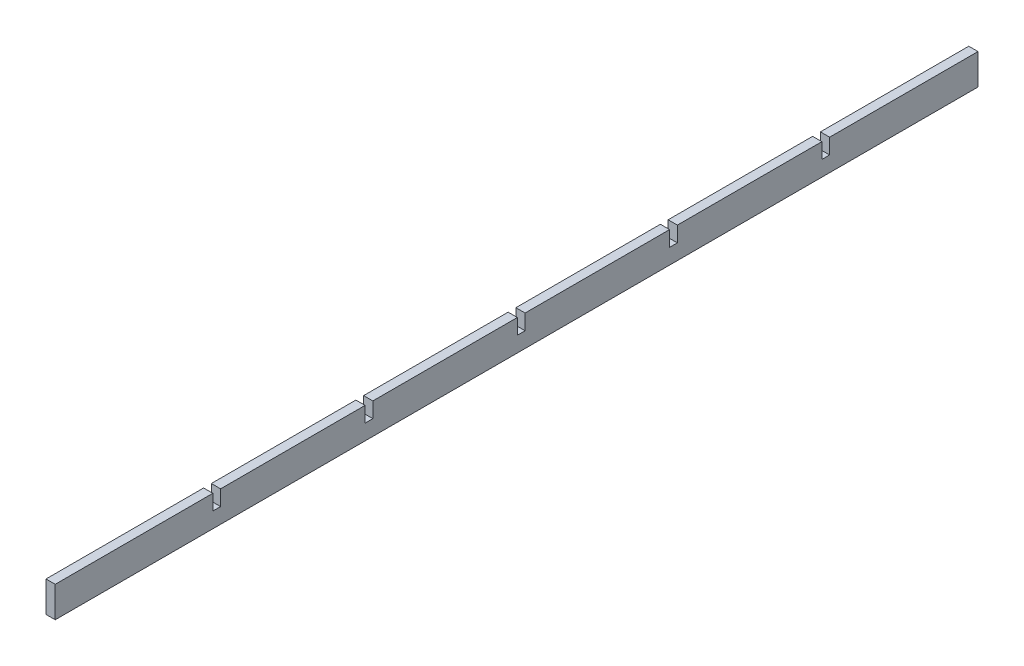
ISO-10303-21;
HEADER;
FILE_DESCRIPTION(('STEP AP214'),'2;1');
FILE_NAME('part.step','',(''),(''),'','','');
FILE_SCHEMA(('AUTOMOTIVE_DESIGN { 1 0 10303 214 1 1 1 1 }'));
ENDSEC;
DATA;
#1=APPLICATION_CONTEXT('core data for automotive mechanical design processes');
#2=APPLICATION_PROTOCOL_DEFINITION('international standard','automotive_design',2000,#1);
#3=PRODUCT_CONTEXT('',#1,'mechanical');
#4=PRODUCT('Part','Part','',(#3));
#5=PRODUCT_RELATED_PRODUCT_CATEGORY('part','',(#4));
#6=PRODUCT_DEFINITION_FORMATION('','',#4);
#7=PRODUCT_DEFINITION_CONTEXT('part definition',#1,'design');
#8=PRODUCT_DEFINITION('design','',#6,#7);
#9=PRODUCT_DEFINITION_SHAPE('','',#8);
#10=(LENGTH_UNIT() NAMED_UNIT(*) SI_UNIT(.MILLI.,.METRE.));
#11=(NAMED_UNIT(*) PLANE_ANGLE_UNIT() SI_UNIT($,.RADIAN.));
#12=(NAMED_UNIT(*) SI_UNIT($,.STERADIAN.) SOLID_ANGLE_UNIT());
#13=UNCERTAINTY_MEASURE_WITH_UNIT(LENGTH_MEASURE(1.E-05),#10,'distance_accuracy_value','');
#14=(GEOMETRIC_REPRESENTATION_CONTEXT(3) GLOBAL_UNCERTAINTY_ASSIGNED_CONTEXT((#13)) GLOBAL_UNIT_ASSIGNED_CONTEXT((#10,
#11,#12)) REPRESENTATION_CONTEXT('',''));
#15=CARTESIAN_POINT('',(0.,0.,0.));
#16=DIRECTION('',(0.,0.,1.));
#17=DIRECTION('',(1.,0.,0.));
#18=AXIS2_PLACEMENT_3D('',#15,#16,#17);
#19=CARTESIAN_POINT('',(3.,5.,148.5));
#20=DIRECTION('',(0.,-1.,0.));
#21=DIRECTION('',(0.,0.,-1.));
#22=AXIS2_PLACEMENT_3D('',#19,#20,#21);
#23=PLANE('',#22);
#24=DIRECTION('',(0.,0.,1.));
#25=VECTOR('',#24,1.);
#26=CARTESIAN_POINT('',(3.,5.,148.5));
#27=LINE('',#26,#25);
#28=CARTESIAN_POINT('',(3.,5.,-100.74));
#29=VERTEX_POINT('',#28);
#30=CARTESIAN_POINT('',(3.,4.99999999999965,-53.76));
#31=VERTEX_POINT('',#30);
#32=EDGE_CURVE('E308',#29,#31,#27,.T.);
#33=ORIENTED_EDGE('',*,*,#32,.F.);
#34=DIRECTION('',(1.,0.,0.));
#35=VECTOR('',#34,1.);
#36=CARTESIAN_POINT('',(-7.,5.,-100.74));
#37=LINE('',#36,#35);
#38=CARTESIAN_POINT('',(0.,5.,-100.74));
#39=VERTEX_POINT('',#38);
#40=EDGE_CURVE('E214',#39,#29,#37,.T.);
#41=ORIENTED_EDGE('',*,*,#40,.F.);
#42=DIRECTION('',(0.,0.,1.));
#43=VECTOR('',#42,1.);
#44=CARTESIAN_POINT('',(0.,5.,148.5));
#45=LINE('',#44,#43);
#46=CARTESIAN_POINT('',(0.,4.99999999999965,-53.76));
#47=VERTEX_POINT('',#46);
#48=EDGE_CURVE('E318',#39,#47,#45,.T.);
#49=ORIENTED_EDGE('',*,*,#48,.T.);
#50=DIRECTION('',(1.,0.,0.));
#51=VECTOR('',#50,1.);
#52=CARTESIAN_POINT('',(-7.,4.99999999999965,-53.76));
#53=LINE('',#52,#51);
#54=EDGE_CURVE('E237',#47,#31,#53,.T.);
#55=ORIENTED_EDGE('',*,*,#54,.T.);
#56=EDGE_LOOP('',(#33,#41,#49,#55));
#57=FACE_BOUND('',#56,.T.);
#58=ADVANCED_FACE('F40',(#57),#23,.F.);
#59=CARTESIAN_POINT('',(0.,5.,-151.5));
#60=VERTEX_POINT('',#59);
#61=CARTESIAN_POINT('',(0.,5.,-103.26));
#62=VERTEX_POINT('',#61);
#63=EDGE_CURVE('E300',#60,#62,#45,.T.);
#64=ORIENTED_EDGE('',*,*,#63,.T.);
#65=DIRECTION('',(1.,0.,0.));
#66=VECTOR('',#65,1.);
#67=CARTESIAN_POINT('',(-7.,5.,-103.26));
#68=LINE('',#67,#66);
#69=CARTESIAN_POINT('',(3.,5.,-103.26));
#70=VERTEX_POINT('',#69);
#71=EDGE_CURVE('E227',#62,#70,#68,.T.);
#72=ORIENTED_EDGE('',*,*,#71,.T.);
#73=CARTESIAN_POINT('',(3.,5.,-151.5));
#74=VERTEX_POINT('',#73);
#75=EDGE_CURVE('E305',#74,#70,#27,.T.);
#76=ORIENTED_EDGE('',*,*,#75,.F.);
#77=DIRECTION('',(-1.,0.,0.));
#78=VECTOR('',#77,1.);
#79=CARTESIAN_POINT('',(3.,5.,-151.5));
#80=LINE('',#79,#78);
#81=EDGE_CURVE('E321',#74,#60,#80,.T.);
#82=ORIENTED_EDGE('',*,*,#81,.T.);
#83=EDGE_LOOP('',(#64,#72,#76,#82));
#84=FACE_BOUND('',#83,.T.);
#85=ADVANCED_FACE('F374',(#84),#23,.F.);
#86=CARTESIAN_POINT('',(3.,4.99999999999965,-51.24));
#87=VERTEX_POINT('',#86);
#88=CARTESIAN_POINT('',(3.,4.99999999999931,-4.26000000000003));
#89=VERTEX_POINT('',#88);
#90=EDGE_CURVE('E418',#87,#89,#27,.T.);
#91=ORIENTED_EDGE('',*,*,#90,.F.);
#92=DIRECTION('',(1.,0.,0.));
#93=VECTOR('',#92,1.);
#94=CARTESIAN_POINT('',(-7.,4.99999999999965,-51.24));
#95=LINE('',#94,#93);
#96=CARTESIAN_POINT('',(0.,4.99999999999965,-51.24));
#97=VERTEX_POINT('',#96);
#98=EDGE_CURVE('E231',#97,#87,#95,.T.);
#99=ORIENTED_EDGE('',*,*,#98,.F.);
#100=CARTESIAN_POINT('',(0.,4.99999999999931,-4.26000000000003));
#101=VERTEX_POINT('',#100);
#102=EDGE_CURVE('E400',#97,#101,#45,.T.);
#103=ORIENTED_EDGE('',*,*,#102,.T.);
#104=DIRECTION('',(1.,0.,0.));
#105=VECTOR('',#104,1.);
#106=CARTESIAN_POINT('',(-7.,4.99999999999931,-4.26000000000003));
#107=LINE('',#106,#105);
#108=EDGE_CURVE('E253',#101,#89,#107,.T.);
#109=ORIENTED_EDGE('',*,*,#108,.T.);
#110=EDGE_LOOP('',(#91,#99,#103,#109));
#111=FACE_BOUND('',#110,.T.);
#112=ADVANCED_FACE('F457',(#111),#23,.F.);
#113=CARTESIAN_POINT('',(3.,4.99999999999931,-1.74000000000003));
#114=VERTEX_POINT('',#113);
#115=CARTESIAN_POINT('',(3.,4.99999999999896,45.2399999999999));
#116=VERTEX_POINT('',#115);
#117=EDGE_CURVE('E420',#114,#116,#27,.T.);
#118=ORIENTED_EDGE('',*,*,#117,.F.);
#119=DIRECTION('',(1.,0.,0.));
#120=VECTOR('',#119,1.);
#121=CARTESIAN_POINT('',(-7.,4.99999999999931,-1.74000000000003));
#122=LINE('',#121,#120);
#123=CARTESIAN_POINT('',(0.,4.99999999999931,-1.74000000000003));
#124=VERTEX_POINT('',#123);
#125=EDGE_CURVE('E246',#124,#114,#122,.T.);
#126=ORIENTED_EDGE('',*,*,#125,.F.);
#127=CARTESIAN_POINT('',(0.,4.99999999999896,45.2399999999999));
#128=VERTEX_POINT('',#127);
#129=EDGE_CURVE('E395',#124,#128,#45,.T.);
#130=ORIENTED_EDGE('',*,*,#129,.T.);
#131=DIRECTION('',(1.,0.,0.));
#132=VECTOR('',#131,1.);
#133=CARTESIAN_POINT('',(-7.,4.99999999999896,45.2399999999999));
#134=LINE('',#133,#132);
#135=EDGE_CURVE('E270',#128,#116,#134,.T.);
#136=ORIENTED_EDGE('',*,*,#135,.T.);
#137=EDGE_LOOP('',(#118,#126,#130,#136));
#138=FACE_BOUND('',#137,.T.);
#139=ADVANCED_FACE('F455',(#138),#23,.F.);
#140=CARTESIAN_POINT('',(3.,4.99999999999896,47.7599999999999));
#141=VERTEX_POINT('',#140);
#142=CARTESIAN_POINT('',(3.,4.99999999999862,94.7399999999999));
#143=VERTEX_POINT('',#142);
#144=EDGE_CURVE('E424',#141,#143,#27,.T.);
#145=ORIENTED_EDGE('',*,*,#144,.F.);
#146=DIRECTION('',(1.,0.,0.));
#147=VECTOR('',#146,1.);
#148=CARTESIAN_POINT('',(-7.,4.99999999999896,47.7599999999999));
#149=LINE('',#148,#147);
#150=CARTESIAN_POINT('',(0.,4.99999999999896,47.7599999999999));
#151=VERTEX_POINT('',#150);
#152=EDGE_CURVE('E263',#151,#141,#149,.T.);
#153=ORIENTED_EDGE('',*,*,#152,.F.);
#154=CARTESIAN_POINT('',(0.,4.99999999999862,94.7399999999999));
#155=VERTEX_POINT('',#154);
#156=EDGE_CURVE('E393',#151,#155,#45,.T.);
#157=ORIENTED_EDGE('',*,*,#156,.T.);
#158=DIRECTION('',(1.,0.,0.));
#159=VECTOR('',#158,1.);
#160=CARTESIAN_POINT('',(-7.,4.99999999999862,94.7399999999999));
#161=LINE('',#160,#159);
#162=EDGE_CURVE('E287',#155,#143,#161,.T.);
#163=ORIENTED_EDGE('',*,*,#162,.T.);
#164=EDGE_LOOP('',(#145,#153,#157,#163));
#165=FACE_BOUND('',#164,.T.);
#166=ADVANCED_FACE('F442',(#165),#23,.F.);
#167=CARTESIAN_POINT('',(3.,5.,148.5));
#168=DIRECTION('',(0.,0.,-1.));
#169=DIRECTION('',(-1.,0.,0.));
#170=AXIS2_PLACEMENT_3D('',#167,#168,#169);
#171=PLANE('',#170);
#172=DIRECTION('',(0.,-1.,0.));
#173=VECTOR('',#172,1.);
#174=CARTESIAN_POINT('',(0.,5.,148.5));
#175=LINE('',#174,#173);
#176=CARTESIAN_POINT('',(0.,5.,148.5));
#177=VERTEX_POINT('',#176);
#178=CARTESIAN_POINT('',(0.,-5.,148.5));
#179=VERTEX_POINT('',#178);
#180=EDGE_CURVE('E226',#177,#179,#175,.T.);
#181=ORIENTED_EDGE('',*,*,#180,.T.);
#182=DIRECTION('',(-1.,0.,0.));
#183=VECTOR('',#182,1.);
#184=CARTESIAN_POINT('',(3.,-5.,148.5));
#185=LINE('',#184,#183);
#186=CARTESIAN_POINT('',(3.,-5.,148.5));
#187=VERTEX_POINT('',#186);
#188=EDGE_CURVE('E327',#187,#179,#185,.T.);
#189=ORIENTED_EDGE('',*,*,#188,.F.);
#190=DIRECTION('',(0.,-1.,0.));
#191=VECTOR('',#190,1.);
#192=CARTESIAN_POINT('',(3.,5.,148.5));
#193=LINE('',#192,#191);
#194=CARTESIAN_POINT('',(3.,5.,148.5));
#195=VERTEX_POINT('',#194);
#196=EDGE_CURVE('E296',#195,#187,#193,.T.);
#197=ORIENTED_EDGE('',*,*,#196,.F.);
#198=DIRECTION('',(-1.,0.,0.));
#199=VECTOR('',#198,1.);
#200=CARTESIAN_POINT('',(3.,5.,148.5));
#201=LINE('',#200,#199);
#202=EDGE_CURVE('E307',#195,#177,#201,.T.);
#203=ORIENTED_EDGE('',*,*,#202,.T.);
#204=EDGE_LOOP('',(#181,#189,#197,#203));
#205=FACE_BOUND('',#204,.T.);
#206=ADVANCED_FACE('F42',(#205),#171,.F.);
#207=CARTESIAN_POINT('',(3.,-5.,148.5));
#208=DIRECTION('',(0.,1.,0.));
#209=DIRECTION('',(0.,0.,1.));
#210=AXIS2_PLACEMENT_3D('',#207,#208,#209);
#211=PLANE('',#210);
#212=DIRECTION('',(0.,0.,-1.));
#213=VECTOR('',#212,1.);
#214=CARTESIAN_POINT('',(0.,-5.,148.5));
#215=LINE('',#214,#213);
#216=CARTESIAN_POINT('',(0.,-5.,-151.5));
#217=VERTEX_POINT('',#216);
#218=EDGE_CURVE('E311',#179,#217,#215,.T.);
#219=ORIENTED_EDGE('',*,*,#218,.T.);
#220=DIRECTION('',(-1.,0.,0.));
#221=VECTOR('',#220,1.);
#222=CARTESIAN_POINT('',(3.,-5.,-151.5));
#223=LINE('',#222,#221);
#224=CARTESIAN_POINT('',(3.,-5.,-151.5));
#225=VERTEX_POINT('',#224);
#226=EDGE_CURVE('E324',#225,#217,#223,.T.);
#227=ORIENTED_EDGE('',*,*,#226,.F.);
#228=DIRECTION('',(0.,0.,-1.));
#229=VECTOR('',#228,1.);
#230=CARTESIAN_POINT('',(3.,-5.,148.5));
#231=LINE('',#230,#229);
#232=EDGE_CURVE('E299',#187,#225,#231,.T.);
#233=ORIENTED_EDGE('',*,*,#232,.F.);
#234=ORIENTED_EDGE('',*,*,#188,.T.);
#235=EDGE_LOOP('',(#219,#227,#233,#234));
#236=FACE_BOUND('',#235,.T.);
#237=ADVANCED_FACE('F385',(#236),#211,.F.);
#238=CARTESIAN_POINT('',(3.,5.,-151.5));
#239=DIRECTION('',(0.,0.,1.));
#240=DIRECTION('',(1.,0.,0.));
#241=AXIS2_PLACEMENT_3D('',#238,#239,#240);
#242=PLANE('',#241);
#243=DIRECTION('',(0.,1.,0.));
#244=VECTOR('',#243,1.);
#245=CARTESIAN_POINT('',(0.,5.,-151.5));
#246=LINE('',#245,#244);
#247=EDGE_CURVE('E313',#217,#60,#246,.T.);
#248=ORIENTED_EDGE('',*,*,#247,.T.);
#249=ORIENTED_EDGE('',*,*,#81,.F.);
#250=DIRECTION('',(0.,1.,0.));
#251=VECTOR('',#250,1.);
#252=CARTESIAN_POINT('',(3.,5.,-151.5));
#253=LINE('',#252,#251);
#254=EDGE_CURVE('E302',#225,#74,#253,.T.);
#255=ORIENTED_EDGE('',*,*,#254,.F.);
#256=ORIENTED_EDGE('',*,*,#226,.T.);
#257=EDGE_LOOP('',(#248,#249,#255,#256));
#258=FACE_BOUND('',#257,.T.);
#259=ADVANCED_FACE('F379',(#258),#242,.F.);
#260=CARTESIAN_POINT('',(3.,4.99999999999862,97.2599999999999));
#261=VERTEX_POINT('',#260);
#262=EDGE_CURVE('E304',#261,#195,#27,.T.);
#263=ORIENTED_EDGE('',*,*,#262,.F.);
#264=DIRECTION('',(1.,0.,0.));
#265=VECTOR('',#264,1.);
#266=CARTESIAN_POINT('',(-7.,4.99999999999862,97.2599999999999));
#267=LINE('',#266,#265);
#268=CARTESIAN_POINT('',(0.,4.99999999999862,97.2599999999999));
#269=VERTEX_POINT('',#268);
#270=EDGE_CURVE('E280',#269,#261,#267,.T.);
#271=ORIENTED_EDGE('',*,*,#270,.F.);
#272=EDGE_CURVE('E315',#269,#177,#45,.T.);
#273=ORIENTED_EDGE('',*,*,#272,.T.);
#274=ORIENTED_EDGE('',*,*,#202,.F.);
#275=EDGE_LOOP('',(#263,#271,#273,#274));
#276=FACE_BOUND('',#275,.T.);
#277=ADVANCED_FACE('F391',(#276),#23,.F.);
#278=CARTESIAN_POINT('',(3.,0.,0.));
#279=DIRECTION('',(1.,0.,0.));
#280=DIRECTION('',(0.,0.,-1.));
#281=AXIS2_PLACEMENT_3D('',#278,#279,#280);
#282=PLANE('',#281);
#283=DIRECTION('',(0.,-1.,0.));
#284=VECTOR('',#283,1.);
#285=CARTESIAN_POINT('',(3.,5.,-100.74));
#286=LINE('',#285,#284);
#287=CARTESIAN_POINT('',(3.,0.,-100.74));
#288=VERTEX_POINT('',#287);
#289=EDGE_CURVE('E211',#29,#288,#286,.T.);
#290=ORIENTED_EDGE('',*,*,#289,.F.);
#291=ORIENTED_EDGE('',*,*,#32,.T.);
#292=DIRECTION('',(0.,1.,0.));
#293=VECTOR('',#292,1.);
#294=CARTESIAN_POINT('',(3.,4.99999999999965,-53.76));
#295=LINE('',#294,#293);
#296=CARTESIAN_POINT('',(3.,-3.46369708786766E-13,-53.76));
#297=VERTEX_POINT('',#296);
#298=EDGE_CURVE('E233',#297,#31,#295,.T.);
#299=ORIENTED_EDGE('',*,*,#298,.F.);
#300=DIRECTION('',(0.,0.,-1.));
#301=VECTOR('',#300,1.);
#302=CARTESIAN_POINT('',(3.,-3.46524014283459E-13,-51.24));
#303=LINE('',#302,#301);
#304=CARTESIAN_POINT('',(3.,-3.46524014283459E-13,-51.24));
#305=VERTEX_POINT('',#304);
#306=EDGE_CURVE('E242',#305,#297,#303,.T.);
#307=ORIENTED_EDGE('',*,*,#306,.F.);
#308=DIRECTION('',(0.,-1.,0.));
#309=VECTOR('',#308,1.);
#310=CARTESIAN_POINT('',(3.,4.99999999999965,-51.24));
#311=LINE('',#310,#309);
#312=EDGE_CURVE('E218',#87,#305,#311,.T.);
#313=ORIENTED_EDGE('',*,*,#312,.F.);
#314=ORIENTED_EDGE('',*,*,#90,.T.);
#315=DIRECTION('',(0.,1.,0.));
#316=VECTOR('',#315,1.);
#317=CARTESIAN_POINT('',(3.,4.99999999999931,-4.26000000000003));
#318=LINE('',#317,#316);
#319=CARTESIAN_POINT('',(3.,-6.92026361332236E-13,-4.26000000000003));
#320=VERTEX_POINT('',#319);
#321=EDGE_CURVE('E248',#320,#89,#318,.T.);
#322=ORIENTED_EDGE('',*,*,#321,.F.);
#323=DIRECTION('',(0.,0.,-1.));
#324=VECTOR('',#323,1.);
#325=CARTESIAN_POINT('',(3.,-6.92180666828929E-13,-1.74000000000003));
#326=LINE('',#325,#324);
#327=CARTESIAN_POINT('',(3.,-6.92180666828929E-13,-1.74000000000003));
#328=VERTEX_POINT('',#327);
#329=EDGE_CURVE('E258',#328,#320,#326,.T.);
#330=ORIENTED_EDGE('',*,*,#329,.F.);
#331=DIRECTION('',(0.,-1.,0.));
#332=VECTOR('',#331,1.);
#333=CARTESIAN_POINT('',(3.,4.99999999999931,-1.74000000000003));
#334=LINE('',#333,#332);
#335=EDGE_CURVE('E240',#114,#328,#334,.T.);
#336=ORIENTED_EDGE('',*,*,#335,.F.);
#337=ORIENTED_EDGE('',*,*,#117,.T.);
#338=DIRECTION('',(0.,1.,0.));
#339=VECTOR('',#338,1.);
#340=CARTESIAN_POINT('',(3.,4.99999999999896,45.2399999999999));
#341=LINE('',#340,#339);
#342=CARTESIAN_POINT('',(3.,-1.03768301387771E-12,45.2399999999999));
#343=VERTEX_POINT('',#342);
#344=EDGE_CURVE('E265',#343,#116,#341,.T.);
#345=ORIENTED_EDGE('',*,*,#344,.F.);
#346=DIRECTION('',(0.,0.,-1.));
#347=VECTOR('',#346,1.);
#348=CARTESIAN_POINT('',(3.,-1.0378373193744E-12,47.7599999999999));
#349=LINE('',#348,#347);
#350=CARTESIAN_POINT('',(3.,-1.0378373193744E-12,47.7599999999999));
#351=VERTEX_POINT('',#350);
#352=EDGE_CURVE('E275',#351,#343,#349,.T.);
#353=ORIENTED_EDGE('',*,*,#352,.F.);
#354=DIRECTION('',(0.,-1.,0.));
#355=VECTOR('',#354,1.);
#356=CARTESIAN_POINT('',(3.,4.99999999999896,47.7599999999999));
#357=LINE('',#356,#355);
#358=EDGE_CURVE('E256',#141,#351,#357,.T.);
#359=ORIENTED_EDGE('',*,*,#358,.F.);
#360=ORIENTED_EDGE('',*,*,#144,.T.);
#361=DIRECTION('',(0.,1.,0.));
#362=VECTOR('',#361,1.);
#363=CARTESIAN_POINT('',(3.,4.99999999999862,94.7399999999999));
#364=LINE('',#363,#362);
#365=CARTESIAN_POINT('',(3.,-1.38333966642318E-12,94.7399999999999));
#366=VERTEX_POINT('',#365);
#367=EDGE_CURVE('E282',#366,#143,#364,.T.);
#368=ORIENTED_EDGE('',*,*,#367,.F.);
#369=DIRECTION('',(0.,0.,-1.));
#370=VECTOR('',#369,1.);
#371=CARTESIAN_POINT('',(3.,-1.38349397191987E-12,97.2599999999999));
#372=LINE('',#371,#370);
#373=CARTESIAN_POINT('',(3.,-1.38349397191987E-12,97.2599999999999));
#374=VERTEX_POINT('',#373);
#375=EDGE_CURVE('E291',#374,#366,#372,.T.);
#376=ORIENTED_EDGE('',*,*,#375,.F.);
#377=DIRECTION('',(0.,-1.,0.));
#378=VECTOR('',#377,1.);
#379=CARTESIAN_POINT('',(3.,4.99999999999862,97.2599999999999));
#380=LINE('',#379,#378);
#381=EDGE_CURVE('E273',#261,#374,#380,.T.);
#382=ORIENTED_EDGE('',*,*,#381,.F.);
#383=ORIENTED_EDGE('',*,*,#262,.T.);
#384=ORIENTED_EDGE('',*,*,#196,.T.);
#385=ORIENTED_EDGE('',*,*,#232,.T.);
#386=ORIENTED_EDGE('',*,*,#254,.T.);
#387=ORIENTED_EDGE('',*,*,#75,.T.);
#388=DIRECTION('',(0.,1.,0.));
#389=VECTOR('',#388,1.);
#390=CARTESIAN_POINT('',(3.,5.,-103.26));
#391=LINE('',#390,#389);
#392=CARTESIAN_POINT('',(3.,0.,-103.26));
#393=VERTEX_POINT('',#392);
#394=EDGE_CURVE('E208',#393,#70,#391,.T.);
#395=ORIENTED_EDGE('',*,*,#394,.F.);
#396=DIRECTION('',(0.,0.,-1.));
#397=VECTOR('',#396,1.);
#398=CARTESIAN_POINT('',(3.,0.,-100.74));
#399=LINE('',#398,#397);
#400=EDGE_CURVE('E203',#288,#393,#399,.T.);
#401=ORIENTED_EDGE('',*,*,#400,.F.);
#402=EDGE_LOOP('',(#290,#291,#299,#307,#313,#314,#322,#330,#336,#337,#345,#353,#359,#360,#368,
#376,#382,#383,#384,#385,#386,#387,#395,#401));
#403=FACE_BOUND('',#402,.T.);
#404=ADVANCED_FACE('F220',(#403),#282,.T.);
#405=CARTESIAN_POINT('',(0.,0.,0.));
#406=DIRECTION('',(1.,0.,0.));
#407=DIRECTION('',(0.,0.,-1.));
#408=AXIS2_PLACEMENT_3D('',#405,#406,#407);
#409=PLANE('',#408);
#410=ORIENTED_EDGE('',*,*,#48,.F.);
#411=DIRECTION('',(0.,-1.,0.));
#412=VECTOR('',#411,1.);
#413=CARTESIAN_POINT('',(0.,0.,-100.74));
#414=LINE('',#413,#412);
#415=CARTESIAN_POINT('',(0.,0.,-100.74));
#416=VERTEX_POINT('',#415);
#417=EDGE_CURVE('E11',#39,#416,#414,.T.);
#418=ORIENTED_EDGE('',*,*,#417,.T.);
#419=DIRECTION('',(0.,0.,-1.));
#420=VECTOR('',#419,1.);
#421=CARTESIAN_POINT('',(0.,0.,0.));
#422=LINE('',#421,#420);
#423=CARTESIAN_POINT('',(0.,0.,-103.26));
#424=VERTEX_POINT('',#423);
#425=EDGE_CURVE('E206',#416,#424,#422,.T.);
#426=ORIENTED_EDGE('',*,*,#425,.T.);
#427=DIRECTION('',(0.,1.,0.));
#428=VECTOR('',#427,1.);
#429=CARTESIAN_POINT('',(0.,0.,-103.26));
#430=LINE('',#429,#428);
#431=EDGE_CURVE('E48',#424,#62,#430,.T.);
#432=ORIENTED_EDGE('',*,*,#431,.T.);
#433=ORIENTED_EDGE('',*,*,#63,.F.);
#434=ORIENTED_EDGE('',*,*,#247,.F.);
#435=ORIENTED_EDGE('',*,*,#218,.F.);
#436=ORIENTED_EDGE('',*,*,#180,.F.);
#437=ORIENTED_EDGE('',*,*,#272,.F.);
#438=DIRECTION('',(0.,-1.,0.));
#439=VECTOR('',#438,1.);
#440=CARTESIAN_POINT('',(0.,0.,97.2599999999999));
#441=LINE('',#440,#439);
#442=CARTESIAN_POINT('',(0.,-1.38349397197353E-12,97.2599999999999));
#443=VERTEX_POINT('',#442);
#444=EDGE_CURVE('E330',#269,#443,#441,.T.);
#445=ORIENTED_EDGE('',*,*,#444,.T.);
#446=DIRECTION('',(0.,0.,-1.));
#447=VECTOR('',#446,1.);
#448=CARTESIAN_POINT('',(0.,-1.37753851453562E-12,0.));
#449=LINE('',#448,#447);
#450=CARTESIAN_POINT('',(0.,-1.38333966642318E-12,94.7399999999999));
#451=VERTEX_POINT('',#450);
#452=EDGE_CURVE('E333',#443,#451,#449,.T.);
#453=ORIENTED_EDGE('',*,*,#452,.T.);
#454=DIRECTION('',(0.,1.,0.));
#455=VECTOR('',#454,1.);
#456=CARTESIAN_POINT('',(0.,0.,94.7399999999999));
#457=LINE('',#456,#455);
#458=EDGE_CURVE('E336',#451,#155,#457,.T.);
#459=ORIENTED_EDGE('',*,*,#458,.T.);
#460=ORIENTED_EDGE('',*,*,#156,.F.);
#461=DIRECTION('',(0.,-1.,0.));
#462=VECTOR('',#461,1.);
#463=CARTESIAN_POINT('',(0.,0.,47.7599999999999));
#464=LINE('',#463,#462);
#465=CARTESIAN_POINT('',(0.,-1.03783731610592E-12,47.7599999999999));
#466=VERTEX_POINT('',#465);
#467=EDGE_CURVE('E339',#151,#466,#464,.T.);
#468=ORIENTED_EDGE('',*,*,#467,.T.);
#469=DIRECTION('',(0.,0.,-1.));
#470=VECTOR('',#469,1.);
#471=CARTESIAN_POINT('',(0.,-1.03491286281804E-12,0.));
#472=LINE('',#471,#470);
#473=CARTESIAN_POINT('',(0.,-1.03768301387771E-12,45.2399999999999));
#474=VERTEX_POINT('',#473);
#475=EDGE_CURVE('E342',#466,#474,#472,.T.);
#476=ORIENTED_EDGE('',*,*,#475,.T.);
#477=DIRECTION('',(0.,1.,0.));
#478=VECTOR('',#477,1.);
#479=CARTESIAN_POINT('',(0.,0.,45.2399999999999));
#480=LINE('',#479,#478);
#481=EDGE_CURVE('E345',#474,#128,#480,.T.);
#482=ORIENTED_EDGE('',*,*,#481,.T.);
#483=ORIENTED_EDGE('',*,*,#129,.F.);
#484=DIRECTION('',(0.,-1.,0.));
#485=VECTOR('',#484,1.);
#486=CARTESIAN_POINT('',(0.,0.,-1.74000000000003));
#487=LINE('',#486,#485);
#488=CARTESIAN_POINT('',(0.,-6.9218066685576E-13,-1.74000000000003));
#489=VERTEX_POINT('',#488);
#490=EDGE_CURVE('E348',#124,#489,#487,.T.);
#491=ORIENTED_EDGE('',*,*,#490,.T.);
#492=DIRECTION('',(0.,0.,-1.));
#493=VECTOR('',#492,1.);
#494=CARTESIAN_POINT('',(0.,-6.92287211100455E-13,0.));
#495=LINE('',#494,#493);
#496=CARTESIAN_POINT('',(0.,-6.92026361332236E-13,-4.26000000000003));
#497=VERTEX_POINT('',#496);
#498=EDGE_CURVE('E351',#489,#497,#495,.T.);
#499=ORIENTED_EDGE('',*,*,#498,.T.);
#500=DIRECTION('',(0.,1.,0.));
#501=VECTOR('',#500,1.);
#502=CARTESIAN_POINT('',(0.,0.,-4.26000000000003));
#503=LINE('',#502,#501);
#504=EDGE_CURVE('E354',#497,#101,#503,.T.);
#505=ORIENTED_EDGE('',*,*,#504,.T.);
#506=ORIENTED_EDGE('',*,*,#102,.F.);
#507=DIRECTION('',(0.,-1.,0.));
#508=VECTOR('',#507,1.);
#509=CARTESIAN_POINT('',(0.,0.,-51.24));
#510=LINE('',#509,#508);
#511=CARTESIAN_POINT('',(0.,-3.46524010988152E-13,-51.24));
#512=VERTEX_POINT('',#511);
#513=EDGE_CURVE('E357',#97,#512,#510,.T.);
#514=ORIENTED_EDGE('',*,*,#513,.T.);
#515=DIRECTION('',(0.,0.,-1.));
#516=VECTOR('',#515,1.);
#517=CARTESIAN_POINT('',(0.,-3.49661559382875E-13,0.));
#518=LINE('',#517,#516);
#519=CARTESIAN_POINT('',(0.,-3.46369708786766E-13,-53.76));
#520=VERTEX_POINT('',#519);
#521=EDGE_CURVE('E360',#512,#520,#518,.T.);
#522=ORIENTED_EDGE('',*,*,#521,.T.);
#523=DIRECTION('',(0.,1.,0.));
#524=VECTOR('',#523,1.);
#525=CARTESIAN_POINT('',(0.,0.,-53.76));
#526=LINE('',#525,#524);
#527=EDGE_CURVE('E363',#520,#47,#526,.T.);
#528=ORIENTED_EDGE('',*,*,#527,.T.);
#529=EDGE_LOOP('',(#410,#418,#426,#432,#433,#434,#435,#436,#437,#445,#453,#459,#460,#468,#476,
#482,#483,#491,#499,#505,#506,#514,#522,#528));
#530=FACE_BOUND('',#529,.T.);
#531=ADVANCED_FACE('F370',(#530),#409,.F.);
#532=CARTESIAN_POINT('',(-7.,4.99999999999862,94.7399999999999));
#533=DIRECTION('',(0.,0.,-1.));
#534=DIRECTION('',(-1.,0.,0.));
#535=AXIS2_PLACEMENT_3D('',#532,#533,#534);
#536=PLANE('',#535);
#537=DIRECTION('',(1.,0.,0.));
#538=VECTOR('',#537,1.);
#539=CARTESIAN_POINT('',(-7.,-1.38333966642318E-12,94.7399999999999));
#540=LINE('',#539,#538);
#541=EDGE_CURVE('E285',#451,#366,#540,.T.);
#542=ORIENTED_EDGE('',*,*,#541,.T.);
#543=ORIENTED_EDGE('',*,*,#367,.T.);
#544=ORIENTED_EDGE('',*,*,#162,.F.);
#545=ORIENTED_EDGE('',*,*,#458,.F.);
#546=EDGE_LOOP('',(#542,#543,#544,#545));
#547=FACE_BOUND('',#546,.T.);
#548=ADVANCED_FACE('F441',(#547),#536,.F.);
#549=CARTESIAN_POINT('',(-7.,-1.38349397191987E-12,97.2599999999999));
#550=DIRECTION('',(0.,-1.,0.));
#551=DIRECTION('',(0.,0.,-1.));
#552=AXIS2_PLACEMENT_3D('',#549,#550,#551);
#553=PLANE('',#552);
#554=DIRECTION('',(1.,0.,0.));
#555=VECTOR('',#554,1.);
#556=CARTESIAN_POINT('',(-7.,-1.38349397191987E-12,97.2599999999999));
#557=LINE('',#556,#555);
#558=EDGE_CURVE('E283',#443,#374,#557,.T.);
#559=ORIENTED_EDGE('',*,*,#558,.T.);
#560=ORIENTED_EDGE('',*,*,#375,.T.);
#561=ORIENTED_EDGE('',*,*,#541,.F.);
#562=ORIENTED_EDGE('',*,*,#452,.F.);
#563=EDGE_LOOP('',(#559,#560,#561,#562));
#564=FACE_BOUND('',#563,.T.);
#565=ADVANCED_FACE('F439',(#564),#553,.F.);
#566=CARTESIAN_POINT('',(-7.,4.99999999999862,97.2599999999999));
#567=DIRECTION('',(0.,0.,1.));
#568=DIRECTION('',(1.,0.,0.));
#569=AXIS2_PLACEMENT_3D('',#566,#567,#568);
#570=PLANE('',#569);
#571=ORIENTED_EDGE('',*,*,#270,.T.);
#572=ORIENTED_EDGE('',*,*,#381,.T.);
#573=ORIENTED_EDGE('',*,*,#558,.F.);
#574=ORIENTED_EDGE('',*,*,#444,.F.);
#575=EDGE_LOOP('',(#571,#572,#573,#574));
#576=FACE_BOUND('',#575,.T.);
#577=ADVANCED_FACE('F435',(#576),#570,.F.);
#578=CARTESIAN_POINT('',(-7.,4.99999999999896,45.2399999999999));
#579=DIRECTION('',(0.,0.,-1.));
#580=DIRECTION('',(-1.,0.,0.));
#581=AXIS2_PLACEMENT_3D('',#578,#579,#580);
#582=PLANE('',#581);
#583=DIRECTION('',(1.,0.,0.));
#584=VECTOR('',#583,1.);
#585=CARTESIAN_POINT('',(-7.,-1.03768301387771E-12,45.2399999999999));
#586=LINE('',#585,#584);
#587=EDGE_CURVE('E268',#474,#343,#586,.T.);
#588=ORIENTED_EDGE('',*,*,#587,.T.);
#589=ORIENTED_EDGE('',*,*,#344,.T.);
#590=ORIENTED_EDGE('',*,*,#135,.F.);
#591=ORIENTED_EDGE('',*,*,#481,.F.);
#592=EDGE_LOOP('',(#588,#589,#590,#591));
#593=FACE_BOUND('',#592,.T.);
#594=ADVANCED_FACE('F451',(#593),#582,.F.);
#595=CARTESIAN_POINT('',(-7.,-1.0378373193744E-12,47.7599999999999));
#596=DIRECTION('',(0.,-1.,0.));
#597=DIRECTION('',(0.,0.,-1.));
#598=AXIS2_PLACEMENT_3D('',#595,#596,#597);
#599=PLANE('',#598);
#600=DIRECTION('',(1.,0.,0.));
#601=VECTOR('',#600,1.);
#602=CARTESIAN_POINT('',(-7.,-1.0378373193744E-12,47.7599999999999));
#603=LINE('',#602,#601);
#604=EDGE_CURVE('E266',#466,#351,#603,.T.);
#605=ORIENTED_EDGE('',*,*,#604,.T.);
#606=ORIENTED_EDGE('',*,*,#352,.T.);
#607=ORIENTED_EDGE('',*,*,#587,.F.);
#608=ORIENTED_EDGE('',*,*,#475,.F.);
#609=EDGE_LOOP('',(#605,#606,#607,#608));
#610=FACE_BOUND('',#609,.T.);
#611=ADVANCED_FACE('F449',(#610),#599,.F.);
#612=CARTESIAN_POINT('',(-7.,4.99999999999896,47.7599999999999));
#613=DIRECTION('',(0.,0.,1.));
#614=DIRECTION('',(1.,0.,0.));
#615=AXIS2_PLACEMENT_3D('',#612,#613,#614);
#616=PLANE('',#615);
#617=ORIENTED_EDGE('',*,*,#152,.T.);
#618=ORIENTED_EDGE('',*,*,#358,.T.);
#619=ORIENTED_EDGE('',*,*,#604,.F.);
#620=ORIENTED_EDGE('',*,*,#467,.F.);
#621=EDGE_LOOP('',(#617,#618,#619,#620));
#622=FACE_BOUND('',#621,.T.);
#623=ADVANCED_FACE('F445',(#622),#616,.F.);
#624=CARTESIAN_POINT('',(-7.,4.99999999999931,-4.26000000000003));
#625=DIRECTION('',(0.,0.,-1.));
#626=DIRECTION('',(-1.,0.,0.));
#627=AXIS2_PLACEMENT_3D('',#624,#625,#626);
#628=PLANE('',#627);
#629=DIRECTION('',(1.,0.,0.));
#630=VECTOR('',#629,1.);
#631=CARTESIAN_POINT('',(-7.,-6.92026361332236E-13,-4.26000000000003));
#632=LINE('',#631,#630);
#633=EDGE_CURVE('E251',#497,#320,#632,.T.);
#634=ORIENTED_EDGE('',*,*,#633,.T.);
#635=ORIENTED_EDGE('',*,*,#321,.T.);
#636=ORIENTED_EDGE('',*,*,#108,.F.);
#637=ORIENTED_EDGE('',*,*,#504,.F.);
#638=EDGE_LOOP('',(#634,#635,#636,#637));
#639=FACE_BOUND('',#638,.T.);
#640=ADVANCED_FACE('F567',(#639),#628,.F.);
#641=CARTESIAN_POINT('',(-7.,-6.92180666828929E-13,-1.74000000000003));
#642=DIRECTION('',(0.,-1.,0.));
#643=DIRECTION('',(0.,0.,-1.));
#644=AXIS2_PLACEMENT_3D('',#641,#642,#643);
#645=PLANE('',#644);
#646=DIRECTION('',(1.,0.,0.));
#647=VECTOR('',#646,1.);
#648=CARTESIAN_POINT('',(-7.,-6.92180666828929E-13,-1.74000000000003));
#649=LINE('',#648,#647);
#650=EDGE_CURVE('E249',#489,#328,#649,.T.);
#651=ORIENTED_EDGE('',*,*,#650,.T.);
#652=ORIENTED_EDGE('',*,*,#329,.T.);
#653=ORIENTED_EDGE('',*,*,#633,.F.);
#654=ORIENTED_EDGE('',*,*,#498,.F.);
#655=EDGE_LOOP('',(#651,#652,#653,#654));
#656=FACE_BOUND('',#655,.T.);
#657=ADVANCED_FACE('F577',(#656),#645,.F.);
#658=CARTESIAN_POINT('',(-7.,4.99999999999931,-1.74000000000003));
#659=DIRECTION('',(0.,0.,1.));
#660=DIRECTION('',(1.,0.,0.));
#661=AXIS2_PLACEMENT_3D('',#658,#659,#660);
#662=PLANE('',#661);
#663=ORIENTED_EDGE('',*,*,#125,.T.);
#664=ORIENTED_EDGE('',*,*,#335,.T.);
#665=ORIENTED_EDGE('',*,*,#650,.F.);
#666=ORIENTED_EDGE('',*,*,#490,.F.);
#667=EDGE_LOOP('',(#663,#664,#665,#666));
#668=FACE_BOUND('',#667,.T.);
#669=ADVANCED_FACE('F454',(#668),#662,.F.);
#670=CARTESIAN_POINT('',(-7.,4.99999999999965,-53.76));
#671=DIRECTION('',(0.,0.,-1.));
#672=DIRECTION('',(-1.,0.,0.));
#673=AXIS2_PLACEMENT_3D('',#670,#671,#672);
#674=PLANE('',#673);
#675=DIRECTION('',(1.,0.,0.));
#676=VECTOR('',#675,1.);
#677=CARTESIAN_POINT('',(-7.,-3.46369708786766E-13,-53.76));
#678=LINE('',#677,#676);
#679=EDGE_CURVE('E235',#520,#297,#678,.T.);
#680=ORIENTED_EDGE('',*,*,#679,.T.);
#681=ORIENTED_EDGE('',*,*,#298,.T.);
#682=ORIENTED_EDGE('',*,*,#54,.F.);
#683=ORIENTED_EDGE('',*,*,#527,.F.);
#684=EDGE_LOOP('',(#680,#681,#682,#683));
#685=FACE_BOUND('',#684,.T.);
#686=ADVANCED_FACE('F412',(#685),#674,.F.);
#687=CARTESIAN_POINT('',(-7.,-3.46524014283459E-13,-51.24));
#688=DIRECTION('',(0.,-1.,0.));
#689=DIRECTION('',(0.,0.,-1.));
#690=AXIS2_PLACEMENT_3D('',#687,#688,#689);
#691=PLANE('',#690);
#692=DIRECTION('',(1.,0.,0.));
#693=VECTOR('',#692,1.);
#694=CARTESIAN_POINT('',(-7.,-3.46524014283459E-13,-51.24));
#695=LINE('',#694,#693);
#696=EDGE_CURVE('E63',#512,#305,#695,.T.);
#697=ORIENTED_EDGE('',*,*,#696,.T.);
#698=ORIENTED_EDGE('',*,*,#306,.T.);
#699=ORIENTED_EDGE('',*,*,#679,.F.);
#700=ORIENTED_EDGE('',*,*,#521,.F.);
#701=EDGE_LOOP('',(#697,#698,#699,#700));
#702=FACE_BOUND('',#701,.T.);
#703=ADVANCED_FACE('F414',(#702),#691,.F.);
#704=CARTESIAN_POINT('',(-7.,4.99999999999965,-51.24));
#705=DIRECTION('',(0.,0.,1.));
#706=DIRECTION('',(1.,0.,0.));
#707=AXIS2_PLACEMENT_3D('',#704,#705,#706);
#708=PLANE('',#707);
#709=ORIENTED_EDGE('',*,*,#98,.T.);
#710=ORIENTED_EDGE('',*,*,#312,.T.);
#711=ORIENTED_EDGE('',*,*,#696,.F.);
#712=ORIENTED_EDGE('',*,*,#513,.F.);
#713=EDGE_LOOP('',(#709,#710,#711,#712));
#714=FACE_BOUND('',#713,.T.);
#715=ADVANCED_FACE('F616',(#714),#708,.F.);
#716=CARTESIAN_POINT('',(-7.,5.,-100.74));
#717=DIRECTION('',(0.,0.,1.));
#718=DIRECTION('',(1.,0.,0.));
#719=AXIS2_PLACEMENT_3D('',#716,#717,#718);
#720=PLANE('',#719);
#721=ORIENTED_EDGE('',*,*,#40,.T.);
#722=ORIENTED_EDGE('',*,*,#289,.T.);
#723=DIRECTION('',(1.,0.,0.));
#724=VECTOR('',#723,1.);
#725=CARTESIAN_POINT('',(-7.,0.,-100.74));
#726=LINE('',#725,#724);
#727=EDGE_CURVE('E199',#416,#288,#726,.T.);
#728=ORIENTED_EDGE('',*,*,#727,.F.);
#729=ORIENTED_EDGE('',*,*,#417,.F.);
#730=EDGE_LOOP('',(#721,#722,#728,#729));
#731=FACE_BOUND('',#730,.T.);
#732=ADVANCED_FACE('F212',(#731),#720,.F.);
#733=CARTESIAN_POINT('',(-7.,5.,-103.26));
#734=DIRECTION('',(0.,0.,-1.));
#735=DIRECTION('',(-1.,0.,0.));
#736=AXIS2_PLACEMENT_3D('',#733,#734,#735);
#737=PLANE('',#736);
#738=DIRECTION('',(1.,0.,0.));
#739=VECTOR('',#738,1.);
#740=CARTESIAN_POINT('',(-7.,0.,-103.26));
#741=LINE('',#740,#739);
#742=EDGE_CURVE('E55',#424,#393,#741,.T.);
#743=ORIENTED_EDGE('',*,*,#742,.T.);
#744=ORIENTED_EDGE('',*,*,#394,.T.);
#745=ORIENTED_EDGE('',*,*,#71,.F.);
#746=ORIENTED_EDGE('',*,*,#431,.F.);
#747=EDGE_LOOP('',(#743,#744,#745,#746));
#748=FACE_BOUND('',#747,.T.);
#749=ADVANCED_FACE('F635',(#748),#737,.F.);
#750=CARTESIAN_POINT('',(-7.,0.,-100.74));
#751=DIRECTION('',(0.,-1.,0.));
#752=DIRECTION('',(0.,0.,-1.));
#753=AXIS2_PLACEMENT_3D('',#750,#751,#752);
#754=PLANE('',#753);
#755=ORIENTED_EDGE('',*,*,#727,.T.);
#756=ORIENTED_EDGE('',*,*,#400,.T.);
#757=ORIENTED_EDGE('',*,*,#742,.F.);
#758=ORIENTED_EDGE('',*,*,#425,.F.);
#759=EDGE_LOOP('',(#755,#756,#757,#758));
#760=FACE_BOUND('',#759,.T.);
#761=ADVANCED_FACE('F201',(#760),#754,.F.);
#762=CLOSED_SHELL('',(#58,#85,#112,#139,#166,#206,#237,#259,#277,#404,#531,#548,#565,#577,#594,
#611,#623,#640,#657,#669,#686,#703,#715,#732,#749,#761));
#763=MANIFOLD_SOLID_BREP('B2',#762);
#764=ADVANCED_BREP_SHAPE_REPRESENTATION('',(#18,#763),#14);
#765=SHAPE_DEFINITION_REPRESENTATION(#9,#764);
ENDSEC;
END-ISO-10303-21;
